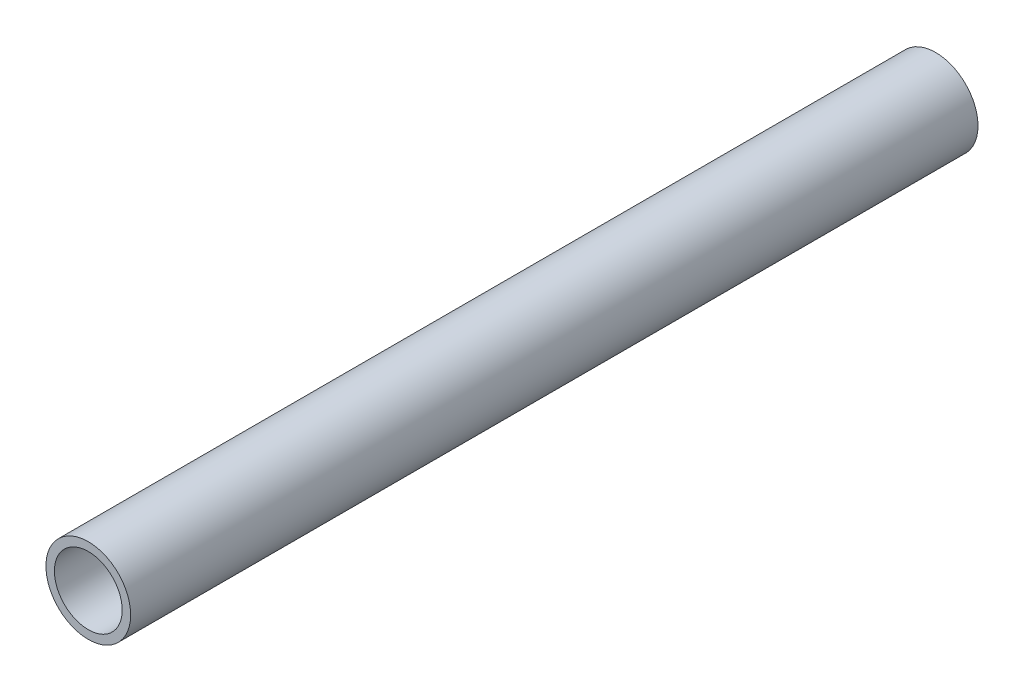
from build123d import *

# Parameters (mm, degrees)
SKETCH_1_R      = 5
SKETCH_1_R_2    = 4
EXTRUDE_1_DEPTH = 100


with BuildPart() as part:
    # Sketch 1 → Extrude 1 (new body)
    with BuildSketch(Plane.XY):
        with Locations((-8.394660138, 5.564999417)):
            Circle(SKETCH_1_R)
        with Locations((-8.394660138, 5.564999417)):
            Circle(SKETCH_1_R_2, mode=Mode.SUBTRACT)
    extrude(amount=EXTRUDE_1_DEPTH)


solid = part.part
